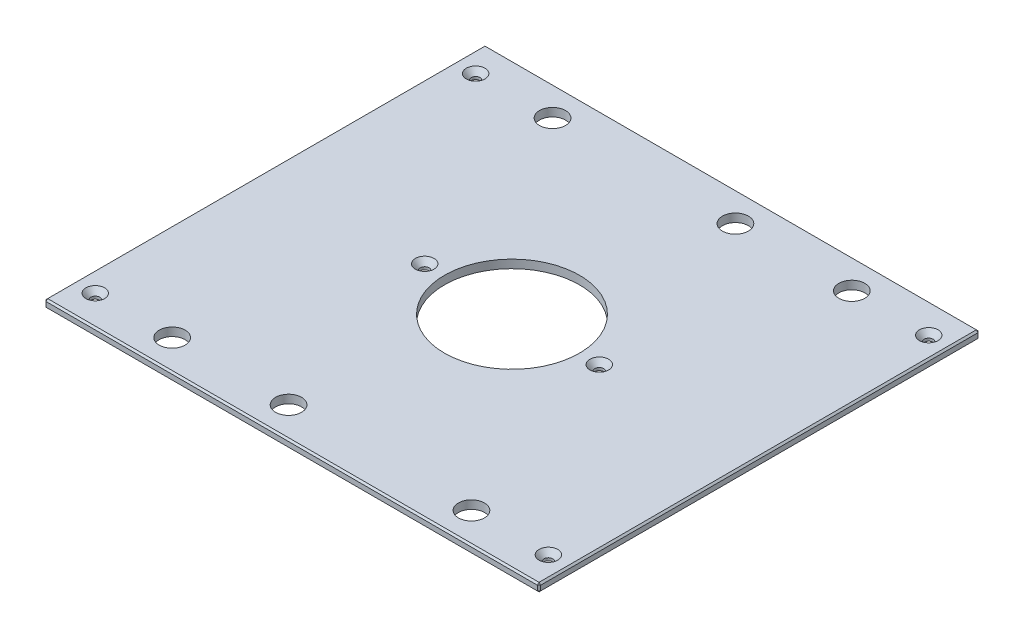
from build123d import *

# Parameters (mm, degrees)
SKETCH1_W                                     = 377.825
SKETCH1_H                                     = 336.55
BOSS_EXTRUDE1_DEPTH                           = 6.35
SKETCH13_R                                    = 51.562
CUT_EXTRUDE6_DEPTH                            = 254.07060434
F_25_32_0_78125_DIAMETER_HOLE1_D              = 19.84375
CHAMFER2_SIZE                                 = 1.27
CSK_FOR_1_4_FLAT_HEAD_MACHINE_SCREW1_AT_COUNT = 2
CSK_FOR_1_4_FLAT_HEAD_MACHINE_SCREW1_AT_PITCH = 290.50996
CSK_FOR_1_4_FLAT_HEAD_MACHINE_SCREW1_2_COUNT  = 2
CSK_FOR_1_4_FLAT_HEAD_MACHINE_SCREW1_2_PITCH  = 451.845042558
CSK_FOR_1_4_FLAT_HEAD_MACHINE_SCREW1_3_COUNT  = 2
CSK_FOR_1_4_FLAT_HEAD_MACHINE_SCREW1_3_PITCH  = 280.287516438
CSK_FOR_1_4_FLAT_HEAD_MACHINE_SCREW1_4_COUNT  = 2
CSK_FOR_1_4_FLAT_HEAD_MACHINE_SCREW1_4_PITCH  = 180.0333042
CSK_FOR_1_4_FLAT_HEAD_MACHINE_SCREW1_5_COUNT  = 2
CSK_FOR_1_4_FLAT_HEAD_MACHINE_SCREW1_5_PITCH  = 346.075
CSK_FOR_1_4_FLAT_HEAD_MACHINE_SCREW1_6_COUNT  = 2
CSK_FOR_1_4_FLAT_HEAD_MACHINE_SCREW1_6_PITCH  = 287.3375
CSK_FOR_1_4_FLAT_HEAD_MACHINE_SCREW1_7_COUNT  = 2
CSK_FOR_1_4_FLAT_HEAD_MACHINE_SCREW1_7_PITCH  = 408.606015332


with BuildPart() as part:
    # Sketch1 → Boss-Extrude1 (new body)
    with BuildSketch(Plane(origin=(0, 0, 0), x_dir=(1, 0, 0), z_dir=(0, 1, 0))):
        Rectangle(SKETCH1_W, SKETCH1_H)
    extrude(amount=BOSS_EXTRUDE1_DEPTH)

    # Sketch13 → Cut-Extrude6 (cut, through all)
    with BuildSketch(Plane(origin=(0, 6.35, 0), x_dir=(1, 0, 0), z_dir=(0, 1, 0))):
        with Locations(Location((0, 0, 0), (0, 0, 270))):
            Circle(SKETCH13_R)
    extrude(amount=-CUT_EXTRUDE6_DEPTH, mode=Mode.SUBTRACT)

    # 25_32 _0.78125_ Diameter Hole1 (through all)
    with Locations(Plane(origin=(0, 6.35, 0), x_dir=(1, 0, 0), z_dir=(0, 1, 0))):
        with Locations((114.3, 145.25498), (-114.3, 145.25498), (114.3, -145.25498), (-114.3, -145.25498), (25.4, 145.25498), (-25.4, -145.25498)):
            Hole(F_25_32_0_78125_DIAMETER_HOLE1_D / 2)

    # Chamfer2
    chamfer2_edges = [part.edges().sort_by_distance(p)[0] for p in [
        (188.9125, 6.35, 0),
        (0, 6.35, -168.275),
        (-188.9125, 6.35, 0),
        (0, 0, -168.275),
        (188.9125, 0, 0),
        (0, 0, 168.275),
        (-188.9125, 0, 0),
        (0, 6.35, 168.275),
        (-188.9125, 3.175, -168.275),
        (188.9125, 3.175, -168.275),
        (188.9125, 3.175, 168.275),
        (-188.9125, 3.175, 168.275),
    ]]
    chamfer(chamfer2_edges, length=CHAMFER2_SIZE)

    # Sketch24 → CSK for 1_4 Flat Head Machine Screw1 (revolve, cut)
    with BuildSketch(Plane(origin=(173.0375, 6.35, -145.25498), x_dir=(0, 0, 1), z_dir=(1, 0, 0))):
        Polygon((0, 0), (0, 6.35), (3.3782, 6.35), (3.3782, 4.324464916), (7.1374, 0), align=None)
    csk_for_1_4_flat_head_machine_screw1 = revolve(axis=Axis((173.0375, 12.7, -145.25498), (0, -1, 0)), mode=Mode.SUBTRACT)

    # CSK for 1_4 Flat Head Machine Screw1 at: CSK for 1_4 Flat Head Machine Screw1 ×2
    with Locations(*[(0, 0, i * CSK_FOR_1_4_FLAT_HEAD_MACHINE_SCREW1_AT_PITCH) for i in range(1, CSK_FOR_1_4_FLAT_HEAD_MACHINE_SCREW1_AT_COUNT)]):
        add(csk_for_1_4_flat_head_machine_screw1, mode=Mode.SUBTRACT)

    # CSK for 1_4 Flat Head Machine Screw1 2: CSK for 1_4 Flat Head Machine Screw1 ×2
    with Locations(*[Vector(-0.7659152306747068, 0, 0.6429415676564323) * (i * CSK_FOR_1_4_FLAT_HEAD_MACHINE_SCREW1_2_PITCH) for i in range(1, CSK_FOR_1_4_FLAT_HEAD_MACHINE_SCREW1_2_COUNT)]):
        add(csk_for_1_4_flat_head_machine_screw1, mode=Mode.SUBTRACT)

    # CSK for 1_4 Flat Head Machine Screw1 3: CSK for 1_4 Flat Head Machine Screw1 ×2
    with Locations(*[Vector(-0.8552378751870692, 0, 0.5182356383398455) * (i * CSK_FOR_1_4_FLAT_HEAD_MACHINE_SCREW1_3_PITCH) for i in range(1, CSK_FOR_1_4_FLAT_HEAD_MACHINE_SCREW1_3_COUNT)]):
        add(csk_for_1_4_flat_head_machine_screw1, mode=Mode.SUBTRACT)

    # CSK for 1_4 Flat Head Machine Screw1 4: CSK for 1_4 Flat Head Machine Screw1 ×2
    with Locations(*[Vector(-0.5907934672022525, 0, 0.8068228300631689) * (i * CSK_FOR_1_4_FLAT_HEAD_MACHINE_SCREW1_4_PITCH) for i in range(1, CSK_FOR_1_4_FLAT_HEAD_MACHINE_SCREW1_4_COUNT)]):
        add(csk_for_1_4_flat_head_machine_screw1, mode=Mode.SUBTRACT)

    # CSK for 1_4 Flat Head Machine Screw1 5: CSK for 1_4 Flat Head Machine Screw1 ×2
    with Locations(*[(-i * CSK_FOR_1_4_FLAT_HEAD_MACHINE_SCREW1_5_PITCH, 0, 0) for i in range(1, CSK_FOR_1_4_FLAT_HEAD_MACHINE_SCREW1_5_COUNT)]):
        add(csk_for_1_4_flat_head_machine_screw1, mode=Mode.SUBTRACT)

    # CSK for 1_4 Flat Head Machine Screw1 6: CSK for 1_4 Flat Head Machine Screw1 ×2
    with Locations(*[(-i * CSK_FOR_1_4_FLAT_HEAD_MACHINE_SCREW1_6_PITCH, 0, 0) for i in range(1, CSK_FOR_1_4_FLAT_HEAD_MACHINE_SCREW1_6_COUNT)]):
        add(csk_for_1_4_flat_head_machine_screw1, mode=Mode.SUBTRACT)

    # CSK for 1_4 Flat Head Machine Screw1 7: CSK for 1_4 Flat Head Machine Screw1 ×2
    with Locations(*[Vector(-0.7032140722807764, 0, 0.7109781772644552) * (i * CSK_FOR_1_4_FLAT_HEAD_MACHINE_SCREW1_7_PITCH) for i in range(1, CSK_FOR_1_4_FLAT_HEAD_MACHINE_SCREW1_7_COUNT)]):
        add(csk_for_1_4_flat_head_machine_screw1, mode=Mode.SUBTRACT)


solid = part.part
